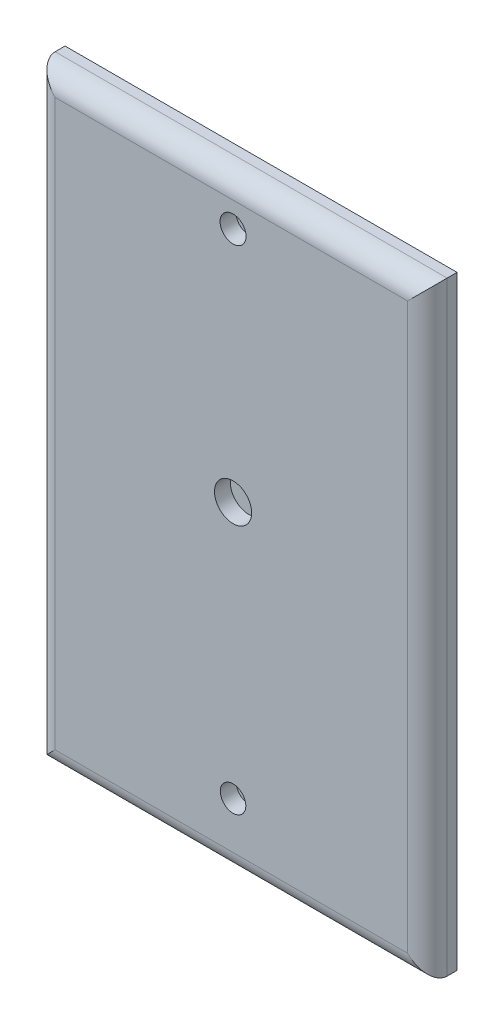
from build123d import *

# Parameters (mm, degrees)
SKETCH1_W          = 201.232511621
SKETCH1_H          = 310.312135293
EXTRUDE1_DEPTH     = 15.24
SKETCH2_R          = 6.672707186
SKETCH2_R_2        = 6.548843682
SKETCH2_R_3        = 9.525
CUT_EXTRUDE1_DEPTH = 8.128
FILLET1_R          = 10.16


with BuildPart() as part:
    # Sketch1 → Extrude1 (new body)
    with BuildSketch(Plane.XY):
        with Locations((-13.812785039, -10.715683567)):
            Rectangle(SKETCH1_W, SKETCH1_H)
    extrude(amount=EXTRUDE1_DEPTH)

    # Sketch2 → Cut-Extrude1 (cut)
    with BuildSketch(Plane.XY.offset(15.24)):
        with Locations((-12.935425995, 121.483730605)):
            Circle(SKETCH2_R)
        with Locations((-12.935425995, -131.710621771)):
            Circle(SKETCH2_R_2)
        with Locations((-12.935425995, 0)):
            Circle(SKETCH2_R_3)
    extrude(amount=-CUT_EXTRUDE1_DEPTH, mode=Mode.SUBTRACT)

    # Fillet1
    fillet1_edges = [part.edges().sort_by_distance(p)[0] for p in [
        (86.803470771, -10.715683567, 15.24),
        (-13.81278504, 144.44038408, 15.24),
        (-114.42904085, -10.715683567, 15.24),
        (-13.81278504, -165.871751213, 15.24),
    ]]
    fillet(fillet1_edges, radius=FILLET1_R)


solid = part.part
